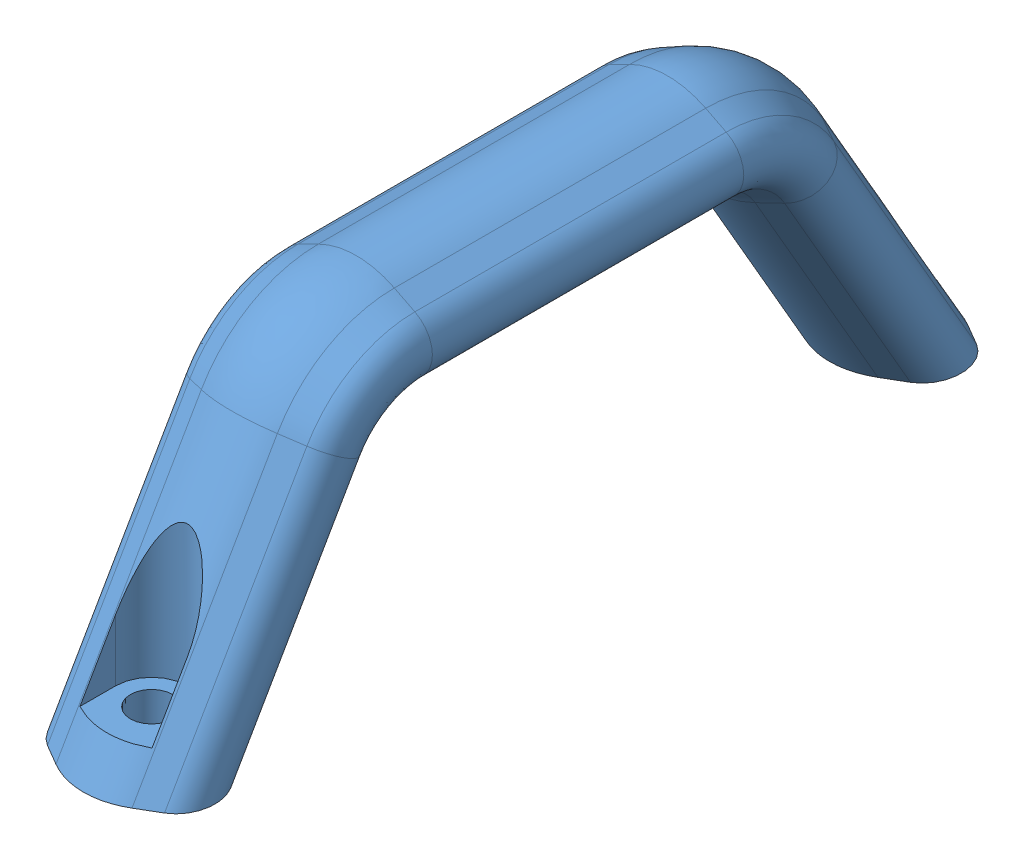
SolidWorks assembly HHDF19.SLDASM, configuration Default (file format 15000). Lengths in mm.
Overall size (19 41 107).
25 component instances, 8 part files, 75 mates.
Components (placement in the parent):
- PULLHANDLE_HHDF19-1: PULLHANDLE_HHDF19.SLDPRT [Default] at origin size (19 41 107)
- NEZI_HHDF19-1: NEZI_HHDF19.SLDPRT [Default] at (0 5 45) x (0 -1 0) z (-1 0 0) (suppressed, hidden)
- NEZI_HHDF19-2: NEZI_HHDF19.SLDPRT [Default] at (0 5 -45) x (0 -1 0) z (-1 0 0) (suppressed, hidden)
- NAT-1_HHDF19-1: NAT-1_HHDF19.SLDPRT [Default] at (0 -2 45) x (0 0 1) z (-1 0 0) (suppressed, hidden)
- NAT-1_HHDF19-2: NAT-1_HHDF19.SLDPRT [Default] at (0 -2 -45) x (0 0 1) z (-1 0 0) (suppressed, hidden)
- NEZI_HHDF19-3: NEZI_HHDF19.SLDPRT [Default] at (0 5 45) x (0 -1 0) z (-1 0 0) (suppressed, hidden)
- NEZI_HHDF19-4: NEZI_HHDF19.SLDPRT [Default] at (0 5 -45) x (0 -1 0) z (-1 0 0) (suppressed, hidden)
- NAT-2_HHDF19-1: NAT-2_HHDF19.SLDPRT [Default] at (0 -2 45) x (0 0 1) z (-1 0 0) (suppressed, hidden)
- NAT-2_HHDF19-2: NAT-2_HHDF19.SLDPRT [Default] at (0 -2 -45) x (0 0 1) z (-1 0 0) (suppressed, hidden)
- NEZI_HHDF19-5: NEZI_HHDF19.SLDPRT [Default] at (0 5 45) x (0 -1 0) z (-1 0 0) (suppressed, hidden)
- NEZI_HHDF19-6: NEZI_HHDF19.SLDPRT [Default] at (0 5 -45) x (0 -1 0) z (-1 0 0) (suppressed, hidden)
- NAT-3_HHDF19-1: NAT-3_HHDF19.SLDPRT [Default] at (0 -2 45) x (0 0 -1) z (1 0 0) (suppressed, hidden)
- NAT-3_HHDF19-2: NAT-3_HHDF19.SLDPRT [Default] at (0 -2 -45) x (0 0 -1) z (1 0 0) (suppressed, hidden)
- NEZI_HHDF19-7: NEZI_HHDF19.SLDPRT [Default] at (0 5 45) x (0 -1 0) z (-1 0 0) (suppressed, hidden)
- NEZI_HHDF19-8: NEZI_HHDF19.SLDPRT [Default] at (0 5 -45) x (0 -1 0) z (-1 0 0) (suppressed, hidden)
- NAT-4_HHDF19-1: NAT-4_HHDF19.SLDPRT [Default] at (0 -2 45) x (0 0 -1) z (1 0 0) (suppressed, hidden)
- NAT-4_HHDF19-2: NAT-4_HHDF19.SLDPRT [Default] at (0 -2 -45) x (0 0 -1) z (1 0 0) (suppressed, hidden)
- NEZI_HHDF19-9: NEZI_HHDF19.SLDPRT [Default] at (0 5 45) x (0 -1 0) z (-1 0 0) (suppressed, hidden)
- NEZI_HHDF19-10: NEZI_HHDF19.SLDPRT [Default] at (0 5 -45) x (0 -1 0) z (-1 0 0) (suppressed, hidden)
- NAT-5_HHDF19-1: NAT-5_HHDF19.SLDPRT [Default] at (0 -2 45) x (0 0 -1) z (1 0 0) (suppressed, hidden)
- NAT-5_HHDF19-2: NAT-5_HHDF19.SLDPRT [Default] at (0 -2 -45) x (0 0 -1) z (1 0 0) (suppressed, hidden)
- NEZI_HHDF19-11: NEZI_HHDF19.SLDPRT [Default] at (0 5 45) x (0 -1 0) z (-1 0 0) (suppressed, hidden)
- NEZI_HHDF19-12: NEZI_HHDF19.SLDPRT [Default] at (0 5 -45) x (0 -1 0) z (-1 0 0) (suppressed, hidden)
- NAT-6_HHDF19-1: NAT-6_HHDF19.SLDPRT [Default] at (0 -2 45) x (0 0 -1) z (1 0 0) (suppressed, hidden)
- NAT-6_HHDF19-2: NAT-6_HHDF19.SLDPRT [Default] at (0 -2 -45) x (0 0 -1) z (1 0 0) (suppressed, hidden)
Mates (geometry in assembly coordinates):
- Coincident1: coincident aligned: plane of PULLHANDLE_BaseModel20251015160119-1 through (0 0 0) normal (0 0 1)
- Coincident2: coincident aligned: plane of PULLHANDLE_BaseModel20251015160119-1 through (0 0 0) normal (0 1 0)
- Coincident3: coincident aligned: plane of PULLHANDLE_BaseModel20251015160119-1 through (0 0 0) normal (1 0 0)
- Concentric1: concentric aligned: cylinder of PULLHANDLE_HHDF19-1 through (0 41 45) axis (0 1 0) radius 2.65; cylinder of ? through (0 10 45) axis (0 1 0) radius 2.5
- Coincident4: coincident anti-aligned: plane of PULLHANDLE_HHDF19-1 through (0 5 49.5) normal (0 1 0); plane of ? through (0 5 47.5) normal (0 -1 0)
- Parallel1: parallel: plane of ? through (0 5 45) normal (-1 0 0); plane of assembly through (0 0 0) normal (1 0 0)
- Concentric2: concentric aligned: cylinder of PULLHANDLE_HHDF19-1 through (0 41 -45) axis (0 1 0) radius 2.65; cylinder of ? through (0 10 -45) axis (0 1 0) radius 2.5
- Coincident5: coincident anti-aligned: plane of PULLHANDLE_HHDF19-1 through (0 5 -49.5) normal (0 1 0); plane of ? through (0 5 -42.5) normal (0 -1 0)
- Parallel2: parallel: plane of ? through (0 5 -45) normal (-1 0 0); plane of assembly through (0 0 0) normal (1 0 0)
- Coincident6: coincident: point of ?; unknown of ?
- Distance1: distance anti-aligned: plane of PULLHANDLE_BaseModel20251015160119-1 through (0 0 0) normal (0 -1 0); plane of NAT-1_BaseModel20251015160119-1 through (0 -2 45) normal (0 1 0)
- Coincident7: coincident anti-aligned: plane of NAT-1_BaseModel20251015160119-1 through (0 -2 45) normal (-1 0 0)
- Coincident8: coincident: plane of ?; point of ?
- Distance2: distance anti-aligned: plane of PULLHANDLE_BaseModel20251015160119-1 through (0 0 0) normal (0 -1 0)
- Coincident9: coincident: plane of ? through (0 -2 -45) normal (-1 0 0); plane of assembly through (0 0 0) normal (1 0 0)
- Concentric3: concentric aligned: cylinder of PULLHANDLE_HHDF19-1 through (0 41 45) axis (0 1 0) radius 2.65; cylinder of ? through (0 10 45) axis (0 1 0) radius 2.5
- Coincident10: coincident anti-aligned: plane of PULLHANDLE_HHDF19-1 through (0 5 49.5) normal (0 1 0); plane of ? through (0 5 47.5) normal (0 -1 0)
- Parallel3: parallel: plane of ? through (0 5 45) normal (-1 0 0); plane of assembly through (0 0 0) normal (1 0 0)
- Concentric4: concentric aligned: cylinder of PULLHANDLE_HHDF19-1 through (0 41 -45) axis (0 1 0) radius 2.65; cylinder of ? through (0 10 -45) axis (0 1 0) radius 2.5
- Coincident11: coincident anti-aligned: plane of PULLHANDLE_HHDF19-1 through (0 5 -49.5) normal (0 1 0); plane of ? through (0 5 -42.5) normal (0 -1 0)
- Parallel4: parallel: plane of ? through (0 5 -45) normal (-1 0 0); plane of assembly through (0 0 0) normal (1 0 0)
- Coincident12: coincident: line of ? through (5 45 0) axis (0 1 0); unknown of ?
- Distance3: distance anti-aligned: plane of NAT-2_BaseModel20251015160119-1 through (0 -2 45) normal (0 1 0); plane of PULLHANDLE_BaseModel20251015160119-1 through (0 0 0) normal (0 -1 0)
- Coincident13: coincident anti-aligned: plane of NAT-2_BaseModel20251015160119-1 through (0 -2 45) normal (-1 0 0)
- Coincident14: coincident: plane of ?; point of ?
- Distance4: distance: unknown of ?; plane of PULLHANDLE_HHDF19-1 through (0 0 0) normal (0 -1 0)
- Coincident15: coincident: plane of ? through (0 -2 -45) normal (-1 0 0); plane of assembly through (0 0 0) normal (1 0 0)
- Concentric5: concentric aligned: cylinder of PULLHANDLE_BaseModel20251015160119-1 through (0 41 45) axis (0 1 0) radius 2.65; cylinder of NEZI_BaseModel20251015160119-5 through (0 10 45) axis (0 1 0) radius 2.5
- Coincident16: coincident anti-aligned: plane of PULLHANDLE_BaseModel20251015160119-1 through (0 5 49.5) normal (0 1 0); plane of NEZI_BaseModel20251015160119-5 through (0 5 47.5) normal (0 -1 0)
- Parallel5: parallel anti-aligned: plane of NEZI_BaseModel20251015160119-5 through (0 5 45) normal (-1 0 0)
- Concentric6: concentric aligned: cylinder of PULLHANDLE_HHDF19-1 through (0 41 -45) axis (0 1 0) radius 2.65; cylinder of ? through (0 10 -45) axis (0 1 0) radius 2.5
- Coincident17: coincident anti-aligned: plane of PULLHANDLE_HHDF19-1 through (0 5 -49.5) normal (0 1 0); plane of ? through (0 5 -42.5) normal (0 -1 0)
- Parallel6: parallel: plane of ? through (0 5 -45) normal (-1 0 0); plane of assembly through (0 0 0) normal (1 0 0)
- Coincident18: coincident: plane of NEZI_BaseModel20251015160119-5 through (0 5 45) normal (0 0 1); point of NAT-3_BaseModel20251015160119-1
- Distance5: distance anti-aligned: plane of PULLHANDLE_BaseModel20251015160119-1 through (0 0 0) normal (0 -1 0); plane of NAT-3_BaseModel20251015160119-1 through (0 -2 45) normal (0 1 0)
- Coincident19: coincident aligned: plane of NAT-3_BaseModel20251015160119-1 through (0 -2 45) normal (1 0 0)
- Coincident20: coincident: plane of ?; point of ?
- Distance6: distance: unknown of ?; plane of PULLHANDLE_HHDF19-1 through (0 0 0) normal (0 -1 0)
- Coincident21: coincident: plane of ? through (0 -2 -45) normal (1 0 0); plane of assembly through (0 0 0) normal (1 0 0)
- Concentric7: concentric aligned: cylinder of PULLHANDLE_HHDF19-1 through (0 41 45) axis (0 1 0) radius 2.65; cylinder of ? through (0 10 45) axis (0 1 0) radius 2.5
- Coincident22: coincident anti-aligned: plane of PULLHANDLE_HHDF19-1 through (0 5 49.5) normal (0 1 0); plane of ? through (0 5 47.5) normal (0 -1 0)
- Parallel7: parallel: plane of ? through (0 5 45) normal (-1 0 0); plane of assembly through (0 0 0) normal (1 0 0)
- Concentric8: concentric aligned: cylinder of PULLHANDLE_HHDF19-1 through (0 41 -45) axis (0 1 0) radius 2.65; cylinder of ? through (0 10 -45) axis (0 1 0) radius 2.5
- Coincident23: coincident anti-aligned: plane of PULLHANDLE_HHDF19-1 through (0 5 -49.5) normal (0 1 0); plane of ? through (0 5 -42.5) normal (0 -1 0)
- Parallel8: parallel: plane of ? through (0 5 -45) normal (-1 0 0); plane of assembly through (0 0 0) normal (1 0 0)
- Coincident24: coincident: unknown of ?; unknown of ?
- Distance7: distance anti-aligned: plane of NAT-4_BaseModel20251015160119-1 through (0 -2 45) normal (0 1 0); plane of PULLHANDLE_BaseModel20251015160119-1 through (0 0 0) normal (0 -1 0)
- Coincident25: coincident aligned: plane of NAT-4_BaseModel20251015160119-1 through (0 -2 45) normal (1 0 0)
- Coincident26: coincident: plane of ?; point of ?
- Distance8: distance: unknown of ?; plane of PULLHANDLE_HHDF19-1 through (0 0 0) normal (0 -1 0)
- Coincident27: coincident: plane of ? through (0 -2 -45) normal (1 0 0); plane of assembly through (0 0 0) normal (1 0 0)
- Concentric9: concentric aligned: cylinder of PULLHANDLE_HHDF19-1 through (0 41 45) axis (0 1 0) radius 2.65; cylinder of ? through (0 10 45) axis (0 1 0) radius 2.5
- Coincident28: coincident anti-aligned: plane of PULLHANDLE_HHDF19-1 through (0 5 49.5) normal (0 1 0); plane of ? through (0 5 47.5) normal (0 -1 0)
- Parallel9: parallel: plane of ? through (0 5 45) normal (-1 0 0); plane of assembly through (0 0 0) normal (1 0 0)
- Concentric10: concentric aligned: cylinder of PULLHANDLE_HHDF19-1 through (0 41 -45) axis (0 1 0) radius 2.65; cylinder of ? through (0 10 -45) axis (0 1 0) radius 2.5
- Coincident29: coincident anti-aligned: plane of PULLHANDLE_HHDF19-1 through (0 5 -49.5) normal (0 1 0); plane of ? through (0 5 -42.5) normal (0 -1 0)
- Parallel10: parallel: plane of ? through (0 5 -45) normal (-1 0 0); plane of assembly through (0 0 0) normal (1 0 0)
- Coincident30: coincident: unknown of ?; unknown of ?
- Distance9: distance anti-aligned: plane of NAT-5_BaseModel20251015160119-1 through (0 -2 45) normal (0 1 0); plane of PULLHANDLE_BaseModel20251015160119-1 through (0 0 0) normal (0 -1 0)
- Coincident31: coincident aligned: plane of NAT-5_BaseModel20251015160119-1 through (0 -2 45) normal (1 0 0)
- Coincident32: coincident: plane of ?; point of ?
- Distance10: distance: unknown of ?; plane of PULLHANDLE_HHDF19-1 through (0 0 0) normal (0 -1 0)
- Coincident33: coincident: plane of ? through (0 -2 -45) normal (1 0 0); plane of assembly through (0 0 0) normal (1 0 0)
- Concentric11: concentric aligned: cylinder of PULLHANDLE_HHDF19-1 through (0 41 45) axis (0 1 0) radius 2.65; cylinder of ? through (0 10 45) axis (0 1 0) radius 2.5
- Coincident34: coincident anti-aligned: plane of PULLHANDLE_HHDF19-1 through (0 5 49.5) normal (0 1 0); plane of ? through (0 5 47.5) normal (0 -1 0)
- Parallel11: parallel: plane of ? through (0 5 45) normal (-1 0 0); plane of assembly through (0 0 0) normal (1 0 0)
- Concentric12: concentric aligned: cylinder of PULLHANDLE_HHDF19-1 through (0 41 -45) axis (0 1 0) radius 2.65; cylinder of ? through (0 10 -45) axis (0 1 0) radius 2.5
- Coincident35: coincident anti-aligned: plane of PULLHANDLE_HHDF19-1 through (0 5 -49.5) normal (0 1 0); plane of ? through (0 5 -42.5) normal (0 -1 0)
- Parallel12: parallel: plane of ? through (0 5 -45) normal (-1 0 0); plane of assembly through (0 0 0) normal (1 0 0)
- Coincident36: coincident: plane of ?; point of ?
- Distance11: distance: line of ? through (-2 45 0) axis (1 0 0); plane of PULLHANDLE_HHDF19-1 through (0 0 0) normal (0 -1 0)
- Coincident37: coincident: plane of ? through (0 -2 45) normal (1 0 0); plane of assembly through (0 0 0) normal (1 0 0)
- Coincident38: coincident: line of ? through (5 -45 0) axis (0 1 0); unknown of ?
- Distance12: distance anti-aligned: plane of NAT-6_BaseModel20251015160119-2 through (0 -2 -45) normal (0 1 0); plane of PULLHANDLE_BaseModel20251015160119-1 through (0 0 0) normal (0 -1 0)
- Coincident39: coincident aligned: plane of NAT-6_BaseModel20251015160119-2 through (0 -2 -45) normal (1 0 0)
